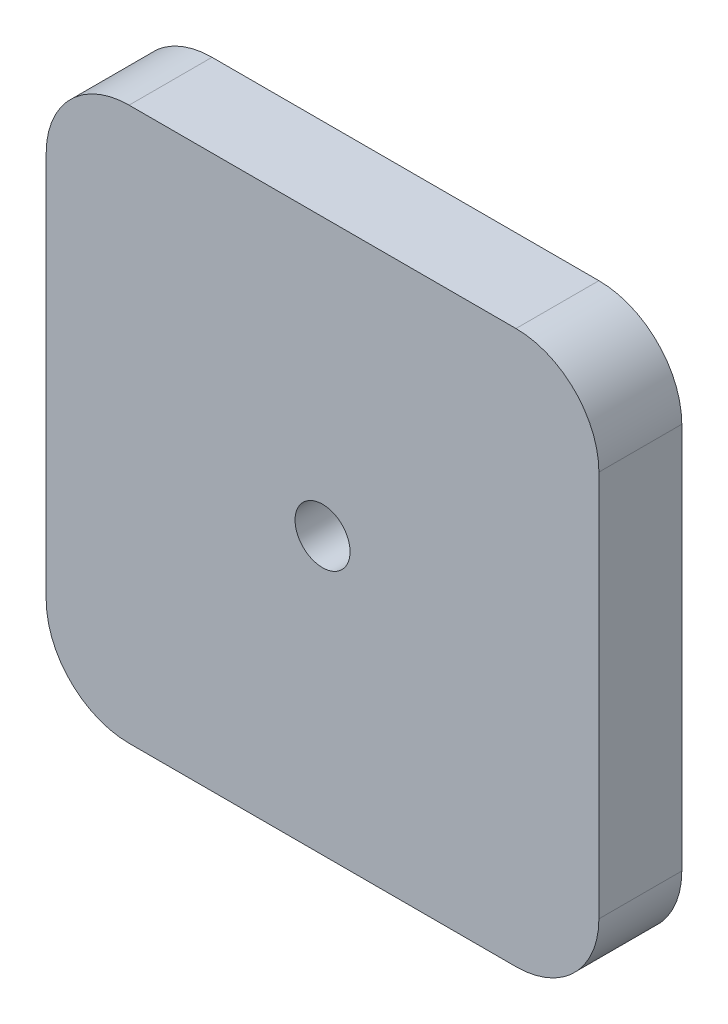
ISO-10303-21;
HEADER;
FILE_DESCRIPTION(('STEP AP214'),'2;1');
FILE_NAME('part.step','',(''),(''),'','','');
FILE_SCHEMA(('AUTOMOTIVE_DESIGN { 1 0 10303 214 1 1 1 1 }'));
ENDSEC;
DATA;
#1=APPLICATION_CONTEXT('core data for automotive mechanical design processes');
#2=APPLICATION_PROTOCOL_DEFINITION('international standard','automotive_design',2000,#1);
#3=PRODUCT_CONTEXT('',#1,'mechanical');
#4=PRODUCT('Part','Part','',(#3));
#5=PRODUCT_RELATED_PRODUCT_CATEGORY('part','',(#4));
#6=PRODUCT_DEFINITION_FORMATION('','',#4);
#7=PRODUCT_DEFINITION_CONTEXT('part definition',#1,'design');
#8=PRODUCT_DEFINITION('design','',#6,#7);
#9=PRODUCT_DEFINITION_SHAPE('','',#8);
#10=(LENGTH_UNIT() NAMED_UNIT(*) SI_UNIT(.MILLI.,.METRE.));
#11=(NAMED_UNIT(*) PLANE_ANGLE_UNIT() SI_UNIT($,.RADIAN.));
#12=(NAMED_UNIT(*) SI_UNIT($,.STERADIAN.) SOLID_ANGLE_UNIT());
#13=UNCERTAINTY_MEASURE_WITH_UNIT(LENGTH_MEASURE(1.E-05),#10,'distance_accuracy_value','');
#14=(GEOMETRIC_REPRESENTATION_CONTEXT(3) GLOBAL_UNCERTAINTY_ASSIGNED_CONTEXT((#13)) GLOBAL_UNIT_ASSIGNED_CONTEXT((#10,
#11,#12)) REPRESENTATION_CONTEXT('',''));
#15=CARTESIAN_POINT('',(0.,0.,0.));
#16=DIRECTION('',(0.,0.,1.));
#17=DIRECTION('',(1.,0.,0.));
#18=AXIS2_PLACEMENT_3D('',#15,#16,#17);
#19=CARTESIAN_POINT('',(-234.342149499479,38.8844140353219,3.));
#20=DIRECTION('',(0.,0.,1.));
#21=DIRECTION('',(1.,0.,0.));
#22=AXIS2_PLACEMENT_3D('',#19,#20,#21);
#23=PLANE('',#22);
#24=CARTESIAN_POINT('',(-234.342149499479,38.8844140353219,3.));
#25=DIRECTION('',(0.,0.,1.));
#26=DIRECTION('',(1.,0.,0.));
#27=AXIS2_PLACEMENT_3D('',#24,#25,#26);
#28=CIRCLE('',#27,3.);
#29=CARTESIAN_POINT('',(-237.342149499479,38.8844140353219,3.));
#30=VERTEX_POINT('',#29);
#31=CARTESIAN_POINT('',(-234.342149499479,35.8844140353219,3.));
#32=VERTEX_POINT('',#31);
#33=EDGE_CURVE('E145',#30,#32,#28,.T.);
#34=ORIENTED_EDGE('',*,*,#33,.T.);
#35=DIRECTION('',(1.,0.,0.));
#36=VECTOR('',#35,1.);
#37=CARTESIAN_POINT('',(-234.342149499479,35.8844140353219,3.));
#38=LINE('',#37,#36);
#39=CARTESIAN_POINT('',(-220.342149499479,35.8844140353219,3.));
#40=VERTEX_POINT('',#39);
#41=EDGE_CURVE('E93',#32,#40,#38,.T.);
#42=ORIENTED_EDGE('',*,*,#41,.T.);
#43=CARTESIAN_POINT('',(-220.342149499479,38.8844140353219,3.));
#44=DIRECTION('',(0.,0.,1.));
#45=DIRECTION('',(1.,0.,0.));
#46=AXIS2_PLACEMENT_3D('',#43,#44,#45);
#47=CIRCLE('',#46,3.);
#48=CARTESIAN_POINT('',(-217.342149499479,38.8844140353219,3.));
#49=VERTEX_POINT('',#48);
#50=EDGE_CURVE('E160',#40,#49,#47,.T.);
#51=ORIENTED_EDGE('',*,*,#50,.T.);
#52=DIRECTION('',(0.,1.,0.));
#53=VECTOR('',#52,1.);
#54=CARTESIAN_POINT('',(-217.342149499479,38.8844140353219,3.));
#55=LINE('',#54,#53);
#56=CARTESIAN_POINT('',(-217.342149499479,52.8844140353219,3.));
#57=VERTEX_POINT('',#56);
#58=EDGE_CURVE('E173',#49,#57,#55,.T.);
#59=ORIENTED_EDGE('',*,*,#58,.T.);
#60=CARTESIAN_POINT('',(-220.342149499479,52.884414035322,3.));
#61=DIRECTION('',(0.,0.,1.));
#62=DIRECTION('',(1.,0.,0.));
#63=AXIS2_PLACEMENT_3D('',#60,#61,#62);
#64=CIRCLE('',#63,3.);
#65=CARTESIAN_POINT('',(-220.342149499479,55.884414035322,3.));
#66=VERTEX_POINT('',#65);
#67=EDGE_CURVE('E112',#57,#66,#64,.T.);
#68=ORIENTED_EDGE('',*,*,#67,.T.);
#69=DIRECTION('',(-1.,0.,0.));
#70=VECTOR('',#69,1.);
#71=CARTESIAN_POINT('',(-234.342149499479,55.884414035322,3.));
#72=LINE('',#71,#70);
#73=CARTESIAN_POINT('',(-234.342149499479,55.884414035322,3.));
#74=VERTEX_POINT('',#73);
#75=EDGE_CURVE('E106',#66,#74,#72,.T.);
#76=ORIENTED_EDGE('',*,*,#75,.T.);
#77=CARTESIAN_POINT('',(-234.342149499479,52.884414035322,3.));
#78=DIRECTION('',(0.,0.,1.));
#79=DIRECTION('',(1.,0.,0.));
#80=AXIS2_PLACEMENT_3D('',#77,#78,#79);
#81=CIRCLE('',#80,3.);
#82=CARTESIAN_POINT('',(-237.342149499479,52.8844140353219,3.));
#83=VERTEX_POINT('',#82);
#84=EDGE_CURVE('E110',#74,#83,#81,.T.);
#85=ORIENTED_EDGE('',*,*,#84,.T.);
#86=DIRECTION('',(0.,-1.,0.));
#87=VECTOR('',#86,1.);
#88=CARTESIAN_POINT('',(-237.342149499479,38.8844140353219,3.));
#89=LINE('',#88,#87);
#90=EDGE_CURVE('E50',#83,#30,#89,.T.);
#91=ORIENTED_EDGE('',*,*,#90,.T.);
#92=EDGE_LOOP('',(#34,#42,#51,#59,#68,#76,#85,#91));
#93=FACE_BOUND('',#92,.T.);
#94=CARTESIAN_POINT('',(-227.342149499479,45.8844140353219,3.));
#95=DIRECTION('',(0.,0.,1.));
#96=DIRECTION('',(1.,0.,0.));
#97=AXIS2_PLACEMENT_3D('',#94,#95,#96);
#98=CIRCLE('',#97,0.995386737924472);
#99=CARTESIAN_POINT('',(-226.346762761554,45.8844140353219,3.));
#100=VERTEX_POINT('',#99);
#101=EDGE_CURVE('E134',#100,#100,#98,.T.);
#102=ORIENTED_EDGE('',*,*,#101,.F.);
#103=EDGE_LOOP('',(#102));
#104=FACE_BOUND('',#103,.T.);
#105=ADVANCED_FACE('F33',(#93,#104),#23,.T.);
#106=CARTESIAN_POINT('',(-234.342149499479,38.8844140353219,0.));
#107=DIRECTION('',(0.,0.,1.));
#108=DIRECTION('',(1.,0.,0.));
#109=AXIS2_PLACEMENT_3D('',#106,#107,#108);
#110=PLANE('',#109);
#111=CARTESIAN_POINT('',(-234.342149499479,38.8844140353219,0.));
#112=DIRECTION('',(0.,0.,1.));
#113=DIRECTION('',(1.,0.,0.));
#114=AXIS2_PLACEMENT_3D('',#111,#112,#113);
#115=CIRCLE('',#114,3.);
#116=CARTESIAN_POINT('',(-237.342149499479,38.8844140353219,0.));
#117=VERTEX_POINT('',#116);
#118=CARTESIAN_POINT('',(-234.342149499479,35.8844140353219,0.));
#119=VERTEX_POINT('',#118);
#120=EDGE_CURVE('E130',#117,#119,#115,.T.);
#121=ORIENTED_EDGE('',*,*,#120,.F.);
#122=DIRECTION('',(0.,-1.,0.));
#123=VECTOR('',#122,1.);
#124=CARTESIAN_POINT('',(-237.342149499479,38.8844140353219,0.));
#125=LINE('',#124,#123);
#126=CARTESIAN_POINT('',(-237.342149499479,52.8844140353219,0.));
#127=VERTEX_POINT('',#126);
#128=EDGE_CURVE('E85',#127,#117,#125,.T.);
#129=ORIENTED_EDGE('',*,*,#128,.F.);
#130=CARTESIAN_POINT('',(-234.342149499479,52.884414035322,0.));
#131=DIRECTION('',(0.,0.,1.));
#132=DIRECTION('',(1.,0.,0.));
#133=AXIS2_PLACEMENT_3D('',#130,#131,#132);
#134=CIRCLE('',#133,3.);
#135=CARTESIAN_POINT('',(-234.342149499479,55.884414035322,0.));
#136=VERTEX_POINT('',#135);
#137=EDGE_CURVE('E79',#136,#127,#134,.T.);
#138=ORIENTED_EDGE('',*,*,#137,.F.);
#139=DIRECTION('',(-1.,0.,0.));
#140=VECTOR('',#139,1.);
#141=CARTESIAN_POINT('',(-234.342149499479,55.884414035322,0.));
#142=LINE('',#141,#140);
#143=CARTESIAN_POINT('',(-220.342149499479,55.884414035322,0.));
#144=VERTEX_POINT('',#143);
#145=EDGE_CURVE('E120',#144,#136,#142,.T.);
#146=ORIENTED_EDGE('',*,*,#145,.F.);
#147=CARTESIAN_POINT('',(-220.342149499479,52.884414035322,0.));
#148=DIRECTION('',(0.,0.,1.));
#149=DIRECTION('',(1.,0.,0.));
#150=AXIS2_PLACEMENT_3D('',#147,#148,#149);
#151=CIRCLE('',#150,3.);
#152=CARTESIAN_POINT('',(-217.342149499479,52.8844140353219,0.));
#153=VERTEX_POINT('',#152);
#154=EDGE_CURVE('E140',#153,#144,#151,.T.);
#155=ORIENTED_EDGE('',*,*,#154,.F.);
#156=DIRECTION('',(0.,1.,0.));
#157=VECTOR('',#156,1.);
#158=CARTESIAN_POINT('',(-217.342149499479,38.8844140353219,0.));
#159=LINE('',#158,#157);
#160=CARTESIAN_POINT('',(-217.342149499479,38.8844140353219,0.));
#161=VERTEX_POINT('',#160);
#162=EDGE_CURVE('E138',#161,#153,#159,.T.);
#163=ORIENTED_EDGE('',*,*,#162,.F.);
#164=CARTESIAN_POINT('',(-220.342149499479,38.8844140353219,0.));
#165=DIRECTION('',(0.,0.,1.));
#166=DIRECTION('',(1.,0.,0.));
#167=AXIS2_PLACEMENT_3D('',#164,#165,#166);
#168=CIRCLE('',#167,3.);
#169=CARTESIAN_POINT('',(-220.342149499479,35.8844140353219,0.));
#170=VERTEX_POINT('',#169);
#171=EDGE_CURVE('E136',#170,#161,#168,.T.);
#172=ORIENTED_EDGE('',*,*,#171,.F.);
#173=DIRECTION('',(1.,0.,0.));
#174=VECTOR('',#173,1.);
#175=CARTESIAN_POINT('',(-234.342149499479,35.8844140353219,0.));
#176=LINE('',#175,#174);
#177=EDGE_CURVE('E133',#119,#170,#176,.T.);
#178=ORIENTED_EDGE('',*,*,#177,.F.);
#179=EDGE_LOOP('',(#121,#129,#138,#146,#155,#163,#172,#178));
#180=FACE_BOUND('',#179,.T.);
#181=CARTESIAN_POINT('',(-227.342149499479,45.8844140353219,0.));
#182=DIRECTION('',(0.,0.,1.));
#183=DIRECTION('',(1.,0.,0.));
#184=AXIS2_PLACEMENT_3D('',#181,#182,#183);
#185=CIRCLE('',#184,0.995386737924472);
#186=CARTESIAN_POINT('',(-226.346762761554,45.8844140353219,0.));
#187=VERTEX_POINT('',#186);
#188=EDGE_CURVE('E179',#187,#187,#185,.T.);
#189=ORIENTED_EDGE('',*,*,#188,.T.);
#190=EDGE_LOOP('',(#189));
#191=FACE_BOUND('',#190,.T.);
#192=ADVANCED_FACE('F164',(#180,#191),#110,.F.);
#193=CARTESIAN_POINT('',(-234.342149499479,38.8844140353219,3.));
#194=DIRECTION('',(0.,0.,-1.));
#195=DIRECTION('',(-1.,0.,0.));
#196=AXIS2_PLACEMENT_3D('',#193,#194,#195);
#197=CYLINDRICAL_SURFACE('',#196,3.);
#198=ORIENTED_EDGE('',*,*,#120,.T.);
#199=DIRECTION('',(0.,0.,-1.));
#200=VECTOR('',#199,1.);
#201=CARTESIAN_POINT('',(-234.342149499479,35.8844140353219,3.));
#202=LINE('',#201,#200);
#203=EDGE_CURVE('E11',#32,#119,#202,.T.);
#204=ORIENTED_EDGE('',*,*,#203,.F.);
#205=ORIENTED_EDGE('',*,*,#33,.F.);
#206=DIRECTION('',(0.,0.,-1.));
#207=VECTOR('',#206,1.);
#208=CARTESIAN_POINT('',(-237.342149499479,38.8844140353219,3.));
#209=LINE('',#208,#207);
#210=EDGE_CURVE('E126',#30,#117,#209,.T.);
#211=ORIENTED_EDGE('',*,*,#210,.T.);
#212=EDGE_LOOP('',(#198,#204,#205,#211));
#213=FACE_BOUND('',#212,.T.);
#214=ADVANCED_FACE('F35',(#213),#197,.T.);
#215=CARTESIAN_POINT('',(-234.342149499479,35.8844140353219,3.));
#216=DIRECTION('',(0.,1.,0.));
#217=DIRECTION('',(0.,0.,1.));
#218=AXIS2_PLACEMENT_3D('',#215,#216,#217);
#219=PLANE('',#218);
#220=ORIENTED_EDGE('',*,*,#177,.T.);
#221=DIRECTION('',(0.,0.,-1.));
#222=VECTOR('',#221,1.);
#223=CARTESIAN_POINT('',(-220.342149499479,35.8844140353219,3.));
#224=LINE('',#223,#222);
#225=EDGE_CURVE('E42',#40,#170,#224,.T.);
#226=ORIENTED_EDGE('',*,*,#225,.F.);
#227=ORIENTED_EDGE('',*,*,#41,.F.);
#228=ORIENTED_EDGE('',*,*,#203,.T.);
#229=EDGE_LOOP('',(#220,#226,#227,#228));
#230=FACE_BOUND('',#229,.T.);
#231=ADVANCED_FACE('F207',(#230),#219,.F.);
#232=CARTESIAN_POINT('',(-220.342149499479,38.8844140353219,3.));
#233=DIRECTION('',(0.,0.,-1.));
#234=DIRECTION('',(-1.,0.,0.));
#235=AXIS2_PLACEMENT_3D('',#232,#233,#234);
#236=CYLINDRICAL_SURFACE('',#235,3.);
#237=ORIENTED_EDGE('',*,*,#171,.T.);
#238=DIRECTION('',(0.,0.,-1.));
#239=VECTOR('',#238,1.);
#240=CARTESIAN_POINT('',(-217.342149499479,38.8844140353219,3.));
#241=LINE('',#240,#239);
#242=EDGE_CURVE('E152',#49,#161,#241,.T.);
#243=ORIENTED_EDGE('',*,*,#242,.F.);
#244=ORIENTED_EDGE('',*,*,#50,.F.);
#245=ORIENTED_EDGE('',*,*,#225,.T.);
#246=EDGE_LOOP('',(#237,#243,#244,#245));
#247=FACE_BOUND('',#246,.T.);
#248=ADVANCED_FACE('F158',(#247),#236,.T.);
#249=CARTESIAN_POINT('',(-217.342149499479,38.8844140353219,3.));
#250=DIRECTION('',(-1.,0.,0.));
#251=DIRECTION('',(0.,0.,1.));
#252=AXIS2_PLACEMENT_3D('',#249,#250,#251);
#253=PLANE('',#252);
#254=ORIENTED_EDGE('',*,*,#162,.T.);
#255=DIRECTION('',(0.,0.,-1.));
#256=VECTOR('',#255,1.);
#257=CARTESIAN_POINT('',(-217.342149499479,52.8844140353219,3.));
#258=LINE('',#257,#256);
#259=EDGE_CURVE('E149',#57,#153,#258,.T.);
#260=ORIENTED_EDGE('',*,*,#259,.F.);
#261=ORIENTED_EDGE('',*,*,#58,.F.);
#262=ORIENTED_EDGE('',*,*,#242,.T.);
#263=EDGE_LOOP('',(#254,#260,#261,#262));
#264=FACE_BOUND('',#263,.T.);
#265=ADVANCED_FACE('F169',(#264),#253,.F.);
#266=CARTESIAN_POINT('',(-220.342149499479,52.884414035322,3.));
#267=DIRECTION('',(0.,0.,-1.));
#268=DIRECTION('',(-1.,0.,0.));
#269=AXIS2_PLACEMENT_3D('',#266,#267,#268);
#270=CYLINDRICAL_SURFACE('',#269,3.);
#271=ORIENTED_EDGE('',*,*,#154,.T.);
#272=DIRECTION('',(0.,0.,-1.));
#273=VECTOR('',#272,1.);
#274=CARTESIAN_POINT('',(-220.342149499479,55.884414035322,3.));
#275=LINE('',#274,#273);
#276=EDGE_CURVE('E121',#66,#144,#275,.T.);
#277=ORIENTED_EDGE('',*,*,#276,.F.);
#278=ORIENTED_EDGE('',*,*,#67,.F.);
#279=ORIENTED_EDGE('',*,*,#259,.T.);
#280=EDGE_LOOP('',(#271,#277,#278,#279));
#281=FACE_BOUND('',#280,.T.);
#282=ADVANCED_FACE('F172',(#281),#270,.T.);
#283=CARTESIAN_POINT('',(-234.342149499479,55.884414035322,3.));
#284=DIRECTION('',(0.,-1.,0.));
#285=DIRECTION('',(0.,0.,-1.));
#286=AXIS2_PLACEMENT_3D('',#283,#284,#285);
#287=PLANE('',#286);
#288=ORIENTED_EDGE('',*,*,#145,.T.);
#289=DIRECTION('',(0.,0.,-1.));
#290=VECTOR('',#289,1.);
#291=CARTESIAN_POINT('',(-234.342149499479,55.884414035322,3.));
#292=LINE('',#291,#290);
#293=EDGE_CURVE('E117',#74,#136,#292,.T.);
#294=ORIENTED_EDGE('',*,*,#293,.F.);
#295=ORIENTED_EDGE('',*,*,#75,.F.);
#296=ORIENTED_EDGE('',*,*,#276,.T.);
#297=EDGE_LOOP('',(#288,#294,#295,#296));
#298=FACE_BOUND('',#297,.T.);
#299=ADVANCED_FACE('F118',(#298),#287,.F.);
#300=CARTESIAN_POINT('',(-234.342149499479,52.884414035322,3.));
#301=DIRECTION('',(0.,0.,-1.));
#302=DIRECTION('',(-1.,0.,0.));
#303=AXIS2_PLACEMENT_3D('',#300,#301,#302);
#304=CYLINDRICAL_SURFACE('',#303,3.);
#305=ORIENTED_EDGE('',*,*,#137,.T.);
#306=DIRECTION('',(0.,0.,-1.));
#307=VECTOR('',#306,1.);
#308=CARTESIAN_POINT('',(-237.342149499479,52.8844140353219,3.));
#309=LINE('',#308,#307);
#310=EDGE_CURVE('E122',#83,#127,#309,.T.);
#311=ORIENTED_EDGE('',*,*,#310,.F.);
#312=ORIENTED_EDGE('',*,*,#84,.F.);
#313=ORIENTED_EDGE('',*,*,#293,.T.);
#314=EDGE_LOOP('',(#305,#311,#312,#313));
#315=FACE_BOUND('',#314,.T.);
#316=ADVANCED_FACE('F124',(#315),#304,.T.);
#317=CARTESIAN_POINT('',(-237.342149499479,38.8844140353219,3.));
#318=DIRECTION('',(1.,0.,0.));
#319=DIRECTION('',(0.,0.,-1.));
#320=AXIS2_PLACEMENT_3D('',#317,#318,#319);
#321=PLANE('',#320);
#322=ORIENTED_EDGE('',*,*,#128,.T.);
#323=ORIENTED_EDGE('',*,*,#210,.F.);
#324=ORIENTED_EDGE('',*,*,#90,.F.);
#325=ORIENTED_EDGE('',*,*,#310,.T.);
#326=EDGE_LOOP('',(#322,#323,#324,#325));
#327=FACE_BOUND('',#326,.T.);
#328=ADVANCED_FACE('F195',(#327),#321,.F.);
#329=CARTESIAN_POINT('',(-227.342149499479,45.8844140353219,3.));
#330=DIRECTION('',(0.,0.,-1.));
#331=DIRECTION('',(-1.,0.,0.));
#332=AXIS2_PLACEMENT_3D('',#329,#330,#331);
#333=CYLINDRICAL_SURFACE('',#332,0.995386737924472);
#334=ORIENTED_EDGE('',*,*,#101,.T.);
#335=EDGE_LOOP('',(#334));
#336=FACE_BOUND('',#335,.T.);
#337=ORIENTED_EDGE('',*,*,#188,.F.);
#338=EDGE_LOOP('',(#337));
#339=FACE_BOUND('',#338,.T.);
#340=ADVANCED_FACE('F185',(#336,#339),#333,.F.);
#341=CLOSED_SHELL('',(#105,#192,#214,#231,#248,#265,#282,#299,#316,#328,#340));
#342=MANIFOLD_SOLID_BREP('B2',#341);
#343=ADVANCED_BREP_SHAPE_REPRESENTATION('',(#18,#342),#14);
#344=SHAPE_DEFINITION_REPRESENTATION(#9,#343);
ENDSEC;
END-ISO-10303-21;
